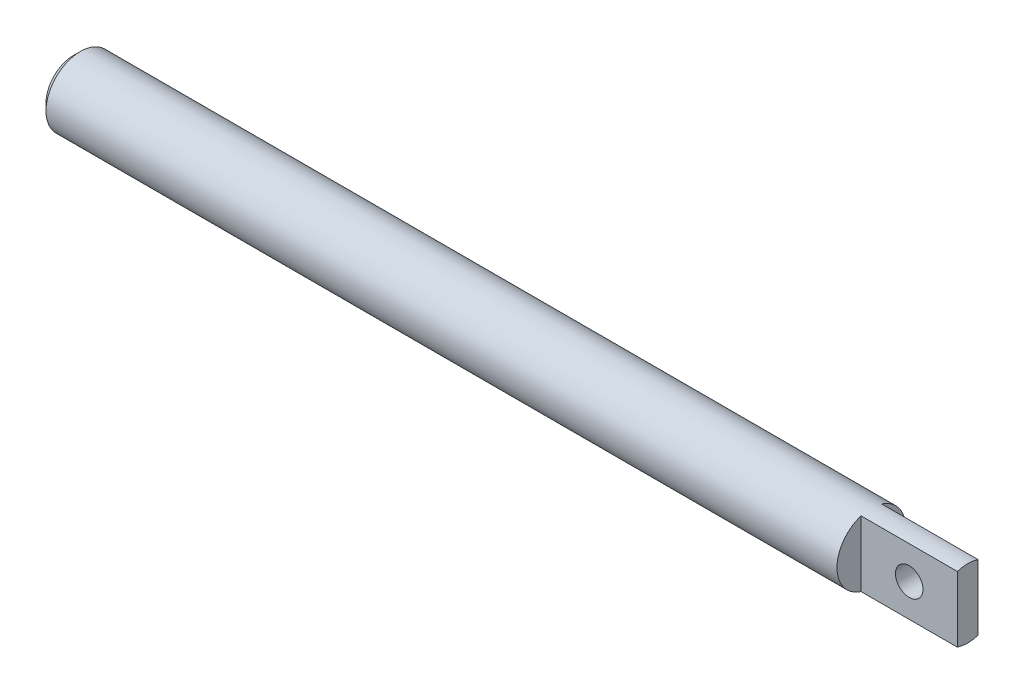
from build123d import *

# Parameters (mm, degrees)
SKETCH3_W          = 7.089450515
SKETCH3_H          = 10
CUT_EXTRUDE2_DEPTH = 14
SKETCH4_R          = 2
CUT_EXTRUDE3_DEPTH = 131.258397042
SKETCH7_W          = 4
SKETCH7_H          = 10.834149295
CUT_EXTRUDE4_DEPTH = 35


with BuildPart() as part:
    # Sketch1 → Revolve1 (revolve)
    with BuildSketch(Plane(origin=(0, 0, 0), x_dir=(1, 0, 0), z_dir=(0, 1, 0)), mode=Mode.PRIVATE) as revolve1_sk:
        Polygon((0, 4), (1, 5), (130, 5), (130, 0), (0, 0), align=None)
    revolve(revolve1_sk.sketch.rotate(Axis((0, 0, 0), (1, 0, 0)), 180), axis=Axis((0, 0, 0), (1, 0, 0)))

    # Sketch3 → Cut-Extrude2 (cut)
    with BuildSketch(Plane(origin=(130, 0, 0), x_dir=(0, 0, -1), z_dir=(1, 0, 0))):
        with Locations((-5.044725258, 0)):
            Rectangle(SKETCH3_W, SKETCH3_H)
        with Locations((5.044725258, 0)):
            Rectangle(SKETCH3_W, SKETCH3_H)
    extrude(amount=-CUT_EXTRUDE2_DEPTH, mode=Mode.SUBTRACT)

    # Sketch4 → Cut-Extrude3 (cut, through all)
    with BuildSketch(Plane(origin=(0, 0, -1.5), x_dir=(-1, 0, 0), z_dir=(0, 0, -1))):
        with Locations((-123, 0)):
            Circle(SKETCH4_R)
    extrude(amount=-CUT_EXTRUDE3_DEPTH, mode=Mode.SUBTRACT)

    # Sketch7 → Cut-Extrude4 (cut, symmetric)
    with BuildSketch(Plane.XY):
        with Locations((60, -9.417074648)):
            Rectangle(SKETCH7_W, SKETCH7_H)
    extrude(amount=CUT_EXTRUDE4_DEPTH, both=True, mode=Mode.SUBTRACT)


solid = part.part
